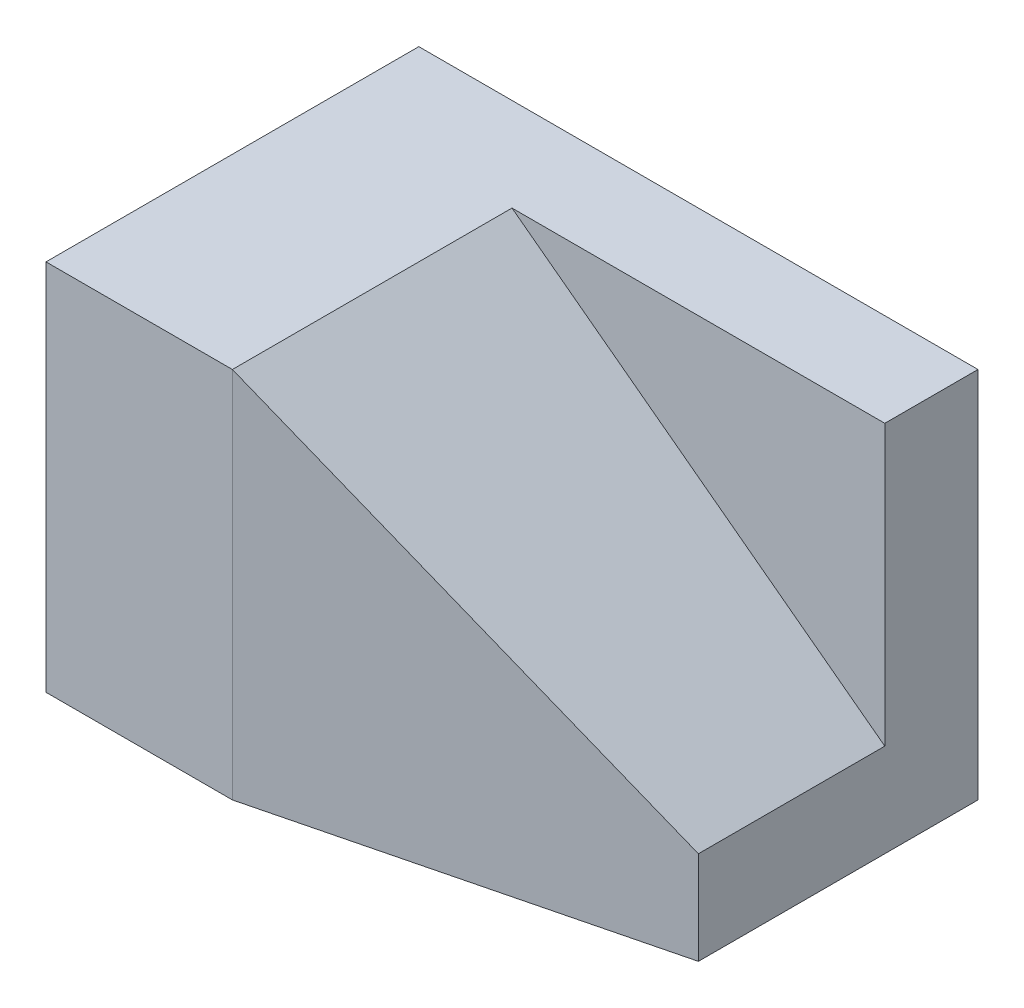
ISO-10303-21;
HEADER;
FILE_DESCRIPTION(('STEP AP214'),'2;1');
FILE_NAME('part.step','',(''),(''),'','','');
FILE_SCHEMA(('AUTOMOTIVE_DESIGN { 1 0 10303 214 1 1 1 1 }'));
ENDSEC;
DATA;
#1=APPLICATION_CONTEXT('core data for automotive mechanical design processes');
#2=APPLICATION_PROTOCOL_DEFINITION('international standard','automotive_design',2000,#1);
#3=PRODUCT_CONTEXT('',#1,'mechanical');
#4=PRODUCT('Part','Part','',(#3));
#5=PRODUCT_RELATED_PRODUCT_CATEGORY('part','',(#4));
#6=PRODUCT_DEFINITION_FORMATION('','',#4);
#7=PRODUCT_DEFINITION_CONTEXT('part definition',#1,'design');
#8=PRODUCT_DEFINITION('design','',#6,#7);
#9=PRODUCT_DEFINITION_SHAPE('','',#8);
#10=(LENGTH_UNIT() NAMED_UNIT(*) SI_UNIT(.MILLI.,.METRE.));
#11=(NAMED_UNIT(*) PLANE_ANGLE_UNIT() SI_UNIT($,.RADIAN.));
#12=(NAMED_UNIT(*) SI_UNIT($,.STERADIAN.) SOLID_ANGLE_UNIT());
#13=UNCERTAINTY_MEASURE_WITH_UNIT(LENGTH_MEASURE(1.E-05),#10,'distance_accuracy_value','');
#14=(GEOMETRIC_REPRESENTATION_CONTEXT(3) GLOBAL_UNCERTAINTY_ASSIGNED_CONTEXT((#13)) GLOBAL_UNIT_ASSIGNED_CONTEXT((#10,
#11,#12)) REPRESENTATION_CONTEXT('',''));
#15=CARTESIAN_POINT('',(0.,0.,0.));
#16=DIRECTION('',(0.,0.,1.));
#17=DIRECTION('',(1.,0.,0.));
#18=AXIS2_PLACEMENT_3D('',#15,#16,#17);
#19=CARTESIAN_POINT('',(-30.,40.,20.));
#20=DIRECTION('',(1.,0.,0.));
#21=DIRECTION('',(0.,0.,-1.));
#22=AXIS2_PLACEMENT_3D('',#19,#20,#21);
#23=PLANE('',#22);
#24=DIRECTION('',(0.,0.,1.));
#25=VECTOR('',#24,1.);
#26=CARTESIAN_POINT('',(-30.,0.,20.));
#27=LINE('',#26,#25);
#28=CARTESIAN_POINT('',(-30.,0.,-20.));
#29=VERTEX_POINT('',#28);
#30=CARTESIAN_POINT('',(-30.,0.,20.));
#31=VERTEX_POINT('',#30);
#32=EDGE_CURVE('E109',#29,#31,#27,.T.);
#33=ORIENTED_EDGE('',*,*,#32,.T.);
#34=DIRECTION('',(0.,-1.,0.));
#35=VECTOR('',#34,1.);
#36=CARTESIAN_POINT('',(-30.,40.,20.));
#37=LINE('',#36,#35);
#38=CARTESIAN_POINT('',(-30.,40.,20.));
#39=VERTEX_POINT('',#38);
#40=EDGE_CURVE('E134',#39,#31,#37,.T.);
#41=ORIENTED_EDGE('',*,*,#40,.F.);
#42=DIRECTION('',(0.,0.,1.));
#43=VECTOR('',#42,1.);
#44=CARTESIAN_POINT('',(-30.,40.,20.));
#45=LINE('',#44,#43);
#46=CARTESIAN_POINT('',(-30.,40.,-20.));
#47=VERTEX_POINT('',#46);
#48=EDGE_CURVE('E113',#47,#39,#45,.T.);
#49=ORIENTED_EDGE('',*,*,#48,.F.);
#50=DIRECTION('',(0.,-1.,0.));
#51=VECTOR('',#50,1.);
#52=CARTESIAN_POINT('',(-30.,40.,-20.));
#53=LINE('',#52,#51);
#54=EDGE_CURVE('E121',#47,#29,#53,.T.);
#55=ORIENTED_EDGE('',*,*,#54,.T.);
#56=EDGE_LOOP('',(#33,#41,#49,#55));
#57=FACE_BOUND('',#56,.T.);
#58=ADVANCED_FACE('F31',(#57),#23,.F.);
#59=CARTESIAN_POINT('',(-30.,40.,20.));
#60=DIRECTION('',(0.,0.,-1.));
#61=DIRECTION('',(-1.,0.,0.));
#62=AXIS2_PLACEMENT_3D('',#59,#60,#61);
#63=PLANE('',#62);
#64=DIRECTION('',(1.,0.,0.));
#65=VECTOR('',#64,1.);
#66=CARTESIAN_POINT('',(-30.,0.,20.));
#67=LINE('',#66,#65);
#68=CARTESIAN_POINT('',(-10.0000000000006,0.,20.));
#69=VERTEX_POINT('',#68);
#70=EDGE_CURVE('E124',#31,#69,#67,.T.);
#71=ORIENTED_EDGE('',*,*,#70,.T.);
#72=DIRECTION('',(0.,1.,0.));
#73=VECTOR('',#72,1.);
#74=CARTESIAN_POINT('',(-10.0000000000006,40.,20.));
#75=LINE('',#74,#73);
#76=CARTESIAN_POINT('',(-10.,40.,20.));
#77=VERTEX_POINT('',#76);
#78=EDGE_CURVE('E39',#69,#77,#75,.T.);
#79=ORIENTED_EDGE('',*,*,#78,.T.);
#80=DIRECTION('',(1.,0.,0.));
#81=VECTOR('',#80,1.);
#82=CARTESIAN_POINT('',(-30.,40.,20.));
#83=LINE('',#82,#81);
#84=EDGE_CURVE('E106',#39,#77,#83,.T.);
#85=ORIENTED_EDGE('',*,*,#84,.F.);
#86=ORIENTED_EDGE('',*,*,#40,.T.);
#87=EDGE_LOOP('',(#71,#79,#85,#86));
#88=FACE_BOUND('',#87,.T.);
#89=ADVANCED_FACE('F140',(#88),#63,.F.);
#90=CARTESIAN_POINT('',(30.,40.,20.));
#91=DIRECTION('',(-1.,0.,0.));
#92=DIRECTION('',(0.,0.,1.));
#93=AXIS2_PLACEMENT_3D('',#90,#91,#92);
#94=PLANE('',#93);
#95=DIRECTION('',(0.,0.,1.));
#96=VECTOR('',#95,1.);
#97=CARTESIAN_POINT('',(30.,10.,-9.99999999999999));
#98=LINE('',#97,#96);
#99=CARTESIAN_POINT('',(30.,10.,-9.99999999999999));
#100=VERTEX_POINT('',#99);
#101=CARTESIAN_POINT('',(30.,10.,9.99999999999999));
#102=VERTEX_POINT('',#101);
#103=EDGE_CURVE('E93',#100,#102,#98,.T.);
#104=ORIENTED_EDGE('',*,*,#103,.T.);
#105=DIRECTION('',(0.,-1.,0.));
#106=VECTOR('',#105,1.);
#107=CARTESIAN_POINT('',(30.,40.,10.));
#108=LINE('',#107,#106);
#109=CARTESIAN_POINT('',(30.,0.,10.));
#110=VERTEX_POINT('',#109);
#111=EDGE_CURVE('E137',#102,#110,#108,.T.);
#112=ORIENTED_EDGE('',*,*,#111,.T.);
#113=DIRECTION('',(0.,0.,-1.));
#114=VECTOR('',#113,1.);
#115=CARTESIAN_POINT('',(30.,0.,20.));
#116=LINE('',#115,#114);
#117=CARTESIAN_POINT('',(30.,0.,-20.));
#118=VERTEX_POINT('',#117);
#119=EDGE_CURVE('E126',#110,#118,#116,.T.);
#120=ORIENTED_EDGE('',*,*,#119,.T.);
#121=DIRECTION('',(0.,-1.,0.));
#122=VECTOR('',#121,1.);
#123=CARTESIAN_POINT('',(30.,40.,-20.));
#124=LINE('',#123,#122);
#125=CARTESIAN_POINT('',(30.,40.,-20.));
#126=VERTEX_POINT('',#125);
#127=EDGE_CURVE('E131',#126,#118,#124,.T.);
#128=ORIENTED_EDGE('',*,*,#127,.F.);
#129=DIRECTION('',(0.,0.,-1.));
#130=VECTOR('',#129,1.);
#131=CARTESIAN_POINT('',(30.,40.,20.));
#132=LINE('',#131,#130);
#133=CARTESIAN_POINT('',(30.,40.,-9.99999999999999));
#134=VERTEX_POINT('',#133);
#135=EDGE_CURVE('E117',#134,#126,#132,.T.);
#136=ORIENTED_EDGE('',*,*,#135,.F.);
#137=DIRECTION('',(0.,1.,0.));
#138=VECTOR('',#137,1.);
#139=CARTESIAN_POINT('',(30.,10.,-9.99999999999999));
#140=LINE('',#139,#138);
#141=EDGE_CURVE('E96',#100,#134,#140,.T.);
#142=ORIENTED_EDGE('',*,*,#141,.F.);
#143=EDGE_LOOP('',(#104,#112,#120,#128,#136,#142));
#144=FACE_BOUND('',#143,.T.);
#145=ADVANCED_FACE('F142',(#144),#94,.F.);
#146=CARTESIAN_POINT('',(-30.,40.,-20.));
#147=DIRECTION('',(0.,0.,1.));
#148=DIRECTION('',(1.,0.,0.));
#149=AXIS2_PLACEMENT_3D('',#146,#147,#148);
#150=PLANE('',#149);
#151=DIRECTION('',(-1.,0.,0.));
#152=VECTOR('',#151,1.);
#153=CARTESIAN_POINT('',(-30.,0.,-20.));
#154=LINE('',#153,#152);
#155=EDGE_CURVE('E115',#118,#29,#154,.T.);
#156=ORIENTED_EDGE('',*,*,#155,.T.);
#157=ORIENTED_EDGE('',*,*,#54,.F.);
#158=DIRECTION('',(-1.,0.,0.));
#159=VECTOR('',#158,1.);
#160=CARTESIAN_POINT('',(-30.,40.,-20.));
#161=LINE('',#160,#159);
#162=EDGE_CURVE('E119',#126,#47,#161,.T.);
#163=ORIENTED_EDGE('',*,*,#162,.F.);
#164=ORIENTED_EDGE('',*,*,#127,.T.);
#165=EDGE_LOOP('',(#156,#157,#163,#164));
#166=FACE_BOUND('',#165,.T.);
#167=ADVANCED_FACE('F149',(#166),#150,.F.);
#168=CARTESIAN_POINT('',(-30.,40.,-20.));
#169=DIRECTION('',(0.,-1.,0.));
#170=DIRECTION('',(0.,0.,-1.));
#171=AXIS2_PLACEMENT_3D('',#168,#169,#170);
#172=PLANE('',#171);
#173=ORIENTED_EDGE('',*,*,#84,.T.);
#174=DIRECTION('',(0.,0.,1.));
#175=VECTOR('',#174,1.);
#176=CARTESIAN_POINT('',(-10.,40.,-9.99999999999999));
#177=LINE('',#176,#175);
#178=CARTESIAN_POINT('',(-10.,40.,-9.99999999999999));
#179=VERTEX_POINT('',#178);
#180=EDGE_CURVE('E90',#179,#77,#177,.T.);
#181=ORIENTED_EDGE('',*,*,#180,.F.);
#182=DIRECTION('',(-1.,0.,0.));
#183=VECTOR('',#182,1.);
#184=CARTESIAN_POINT('',(30.,40.,-9.99999999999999));
#185=LINE('',#184,#183);
#186=EDGE_CURVE('E97',#134,#179,#185,.T.);
#187=ORIENTED_EDGE('',*,*,#186,.F.);
#188=ORIENTED_EDGE('',*,*,#135,.T.);
#189=ORIENTED_EDGE('',*,*,#162,.T.);
#190=ORIENTED_EDGE('',*,*,#48,.T.);
#191=EDGE_LOOP('',(#173,#181,#187,#188,#189,#190));
#192=FACE_BOUND('',#191,.T.);
#193=ADVANCED_FACE('F104',(#192),#172,.F.);
#194=CARTESIAN_POINT('',(-30.,0.,-20.));
#195=DIRECTION('',(0.,-1.,0.));
#196=DIRECTION('',(0.,0.,-1.));
#197=AXIS2_PLACEMENT_3D('',#194,#195,#196);
#198=PLANE('',#197);
#199=ORIENTED_EDGE('',*,*,#119,.F.);
#200=DIRECTION('',(0.970142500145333,0.,-0.24253562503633));
#201=VECTOR('',#200,1.);
#202=CARTESIAN_POINT('',(-19.4117647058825,0.,22.3529411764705));
#203=LINE('',#202,#201);
#204=EDGE_CURVE('E46',#110,#69,#203,.F.);
#205=ORIENTED_EDGE('',*,*,#204,.T.);
#206=ORIENTED_EDGE('',*,*,#70,.F.);
#207=ORIENTED_EDGE('',*,*,#32,.F.);
#208=ORIENTED_EDGE('',*,*,#155,.F.);
#209=EDGE_LOOP('',(#199,#205,#206,#207,#208));
#210=FACE_BOUND('',#209,.T.);
#211=ADVANCED_FACE('F153',(#210),#198,.T.);
#212=CARTESIAN_POINT('',(-10.,40.,-9.99999999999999));
#213=DIRECTION('',(-0.6,-0.8,0.));
#214=DIRECTION('',(0.8,-0.6,0.));
#215=AXIS2_PLACEMENT_3D('',#212,#213,#214);
#216=PLANE('',#215);
#217=ORIENTED_EDGE('',*,*,#180,.T.);
#218=DIRECTION('',(-0.784464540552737,0.588348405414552,0.196116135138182));
#219=VECTOR('',#218,1.);
#220=CARTESIAN_POINT('',(16.1538461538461,20.3846153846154,13.4615384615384));
#221=LINE('',#220,#219);
#222=EDGE_CURVE('E11',#77,#102,#221,.F.);
#223=ORIENTED_EDGE('',*,*,#222,.T.);
#224=ORIENTED_EDGE('',*,*,#103,.F.);
#225=DIRECTION('',(0.8,-0.6,0.));
#226=VECTOR('',#225,1.);
#227=CARTESIAN_POINT('',(-10.,40.,-9.99999999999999));
#228=LINE('',#227,#226);
#229=EDGE_CURVE('E86',#179,#100,#228,.T.);
#230=ORIENTED_EDGE('',*,*,#229,.F.);
#231=EDGE_LOOP('',(#217,#223,#224,#230));
#232=FACE_BOUND('',#231,.T.);
#233=ADVANCED_FACE('F88',(#232),#216,.F.);
#234=CARTESIAN_POINT('',(30.,40.,-9.99999999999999));
#235=DIRECTION('',(0.,0.,-1.));
#236=DIRECTION('',(-1.,0.,0.));
#237=AXIS2_PLACEMENT_3D('',#234,#235,#236);
#238=PLANE('',#237);
#239=ORIENTED_EDGE('',*,*,#186,.T.);
#240=ORIENTED_EDGE('',*,*,#229,.T.);
#241=ORIENTED_EDGE('',*,*,#141,.T.);
#242=EDGE_LOOP('',(#239,#240,#241));
#243=FACE_BOUND('',#242,.T.);
#244=ADVANCED_FACE('F100',(#243),#238,.F.);
#245=CARTESIAN_POINT('',(30.,40.,10.));
#246=DIRECTION('',(-0.24253562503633,0.,-0.970142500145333));
#247=DIRECTION('',(-0.970142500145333,0.,0.24253562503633));
#248=AXIS2_PLACEMENT_3D('',#245,#246,#247);
#249=PLANE('',#248);
#250=ORIENTED_EDGE('',*,*,#222,.F.);
#251=ORIENTED_EDGE('',*,*,#78,.F.);
#252=ORIENTED_EDGE('',*,*,#204,.F.);
#253=ORIENTED_EDGE('',*,*,#111,.F.);
#254=EDGE_LOOP('',(#250,#251,#252,#253));
#255=FACE_BOUND('',#254,.T.);
#256=ADVANCED_FACE('F33',(#255),#249,.F.);
#257=CLOSED_SHELL('',(#58,#89,#145,#167,#193,#211,#233,#244,#256));
#258=MANIFOLD_SOLID_BREP('B2',#257);
#259=ADVANCED_BREP_SHAPE_REPRESENTATION('',(#18,#258),#14);
#260=SHAPE_DEFINITION_REPRESENTATION(#9,#259);
ENDSEC;
END-ISO-10303-21;
